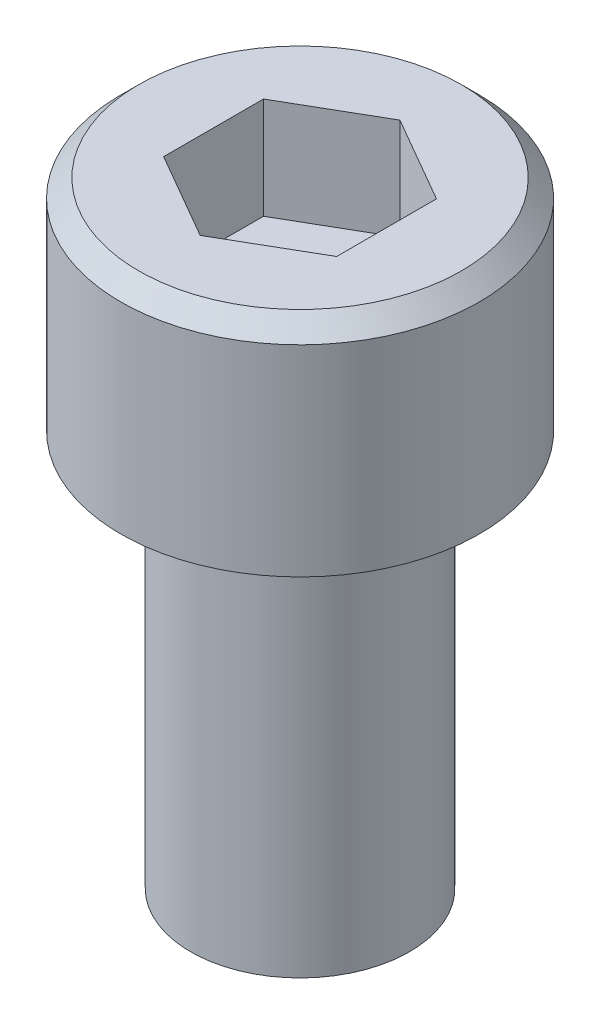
ISO-10303-21;
HEADER;
FILE_DESCRIPTION(('STEP AP214'),'2;1');
FILE_NAME('part.step','',(''),(''),'','','');
FILE_SCHEMA(('AUTOMOTIVE_DESIGN { 1 0 10303 214 1 1 1 1 }'));
ENDSEC;
DATA;
#1=APPLICATION_CONTEXT('core data for automotive mechanical design processes');
#2=APPLICATION_PROTOCOL_DEFINITION('international standard','automotive_design',2000,#1);
#3=PRODUCT_CONTEXT('',#1,'mechanical');
#4=PRODUCT('Part','Part','',(#3));
#5=PRODUCT_RELATED_PRODUCT_CATEGORY('part','',(#4));
#6=PRODUCT_DEFINITION_FORMATION('','',#4);
#7=PRODUCT_DEFINITION_CONTEXT('part definition',#1,'design');
#8=PRODUCT_DEFINITION('design','',#6,#7);
#9=PRODUCT_DEFINITION_SHAPE('','',#8);
#10=(LENGTH_UNIT() NAMED_UNIT(*) SI_UNIT(.MILLI.,.METRE.));
#11=(NAMED_UNIT(*) PLANE_ANGLE_UNIT() SI_UNIT($,.RADIAN.));
#12=(NAMED_UNIT(*) SI_UNIT($,.STERADIAN.) SOLID_ANGLE_UNIT());
#13=UNCERTAINTY_MEASURE_WITH_UNIT(LENGTH_MEASURE(1.E-05),#10,'distance_accuracy_value','');
#14=(GEOMETRIC_REPRESENTATION_CONTEXT(3) GLOBAL_UNCERTAINTY_ASSIGNED_CONTEXT((#13)) GLOBAL_UNIT_ASSIGNED_CONTEXT((#10,
#11,#12)) REPRESENTATION_CONTEXT('',''));
#15=CARTESIAN_POINT('',(0.,0.,0.));
#16=DIRECTION('',(0.,0.,1.));
#17=DIRECTION('',(1.,0.,0.));
#18=AXIS2_PLACEMENT_3D('',#15,#16,#17);
#19=CARTESIAN_POINT('',(0.,0.,0.));
#20=DIRECTION('',(0.,-1.,0.));
#21=DIRECTION('',(0.,0.,-1.00000000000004));
#22=AXIS2_PLACEMENT_3D('',#19,#20,#21);
#23=PLANE('',#22);
#24=CARTESIAN_POINT('',(0.,0.,0.));
#25=DIRECTION('',(0.,-1.,0.));
#26=DIRECTION('',(0.,0.,-1.00000000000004));
#27=AXIS2_PLACEMENT_3D('',#24,#25,#26);
#28=CIRCLE('',#27,1.752598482);
#29=CARTESIAN_POINT('',(0.,0.,-1.75259848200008));
#30=VERTEX_POINT('',#29);
#31=EDGE_CURVE('E11',#30,#30,#28,.T.);
#32=ORIENTED_EDGE('',*,*,#31,.F.);
#33=EDGE_LOOP('',(#32));
#34=FACE_BOUND('',#33,.T.);
#35=CARTESIAN_POINT('',(0.,0.,0.));
#36=DIRECTION('',(0.,-1.,0.));
#37=DIRECTION('',(0.,0.,-1.00000000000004));
#38=AXIS2_PLACEMENT_3D('',#35,#36,#37);
#39=CIRCLE('',#38,2.870197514);
#40=CARTESIAN_POINT('',(0.,0.,-2.87019751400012));
#41=VERTEX_POINT('',#40);
#42=EDGE_CURVE('E41',#41,#41,#39,.T.);
#43=ORIENTED_EDGE('',*,*,#42,.T.);
#44=EDGE_LOOP('',(#43));
#45=FACE_BOUND('',#44,.T.);
#46=ADVANCED_FACE('F38',(#34,#45),#23,.T.);
#47=CARTESIAN_POINT('',(0.,0.,0.));
#48=DIRECTION('',(0.,-1.,0.));
#49=DIRECTION('',(0.,0.,-1.00000000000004));
#50=AXIS2_PLACEMENT_3D('',#47,#48,#49);
#51=CYLINDRICAL_SURFACE('',#50,2.870197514);
#52=CARTESIAN_POINT('',(0.,3.21817727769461,0.));
#53=DIRECTION('',(0.,-1.,0.));
#54=DIRECTION('',(0.,0.,-1.00000000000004));
#55=AXIS2_PLACEMENT_3D('',#52,#53,#54);
#56=CIRCLE('',#55,2.870197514);
#57=CARTESIAN_POINT('',(0.,3.21817727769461,-2.87019751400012));
#58=VERTEX_POINT('',#57);
#59=EDGE_CURVE('E152',#58,#58,#56,.T.);
#60=ORIENTED_EDGE('',*,*,#59,.T.);
#61=EDGE_LOOP('',(#60));
#62=FACE_BOUND('',#61,.T.);
#63=ORIENTED_EDGE('',*,*,#42,.F.);
#64=EDGE_LOOP('',(#63));
#65=FACE_BOUND('',#64,.T.);
#66=ADVANCED_FACE('F160',(#62,#65),#51,.T.);
#67=CARTESIAN_POINT('',(0.,3.21817727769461,0.));
#68=DIRECTION('',(0.,-1.,0.));
#69=DIRECTION('',(0.,0.,-1.00000000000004));
#70=AXIS2_PLACEMENT_3D('',#67,#68,#69);
#71=CONICAL_SURFACE('',#70,2.870197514,0.785398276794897);
#72=CARTESIAN_POINT('',(0.,3.50519696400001,0.));
#73=DIRECTION('',(0.,-1.,0.));
#74=DIRECTION('',(0.,0.,-1.00000000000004));
#75=AXIS2_PLACEMENT_3D('',#72,#73,#74);
#76=CIRCLE('',#75,2.5831777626);
#77=CARTESIAN_POINT('',(0.,3.50519696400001,-2.58317776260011));
#78=VERTEX_POINT('',#77);
#79=EDGE_CURVE('E150',#78,#78,#76,.T.);
#80=ORIENTED_EDGE('',*,*,#79,.T.);
#81=EDGE_LOOP('',(#80));
#82=FACE_BOUND('',#81,.T.);
#83=ORIENTED_EDGE('',*,*,#59,.F.);
#84=EDGE_LOOP('',(#83));
#85=FACE_BOUND('',#84,.T.);
#86=ADVANCED_FACE('F162',(#82,#85),#71,.T.);
#87=CARTESIAN_POINT('',(2.58317776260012,3.50519696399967,0.));
#88=DIRECTION('',(0.,1.,0.));
#89=DIRECTION('',(0.,0.,1.00000000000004));
#90=AXIS2_PLACEMENT_3D('',#87,#88,#89);
#91=PLANE('',#90);
#92=DIRECTION('',(-4.53589793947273E-07,0.,0.999999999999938));
#93=VECTOR('',#92,1.);
#94=CARTESIAN_POINT('',(-1.38429807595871,3.50519696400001,-0.799226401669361));
#95=LINE('',#94,#93);
#96=CARTESIAN_POINT('',(-1.38429807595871,3.50519696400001,-0.799226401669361));
#97=VERTEX_POINT('',#96);
#98=CARTESIAN_POINT('',(-1.384298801,3.50519696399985,0.799225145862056));
#99=VERTEX_POINT('',#98);
#100=EDGE_CURVE('E53',#97,#99,#95,.T.);
#101=ORIENTED_EDGE('',*,*,#100,.F.);
#102=DIRECTION('',(-0.866025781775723,0.,0.499999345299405));
#103=VECTOR('',#102,1.);
#104=CARTESIAN_POINT('',(1.08756126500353E-06,3.50519696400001,-1.59845050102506));
#105=LINE('',#104,#103);
#106=CARTESIAN_POINT('',(1.08756126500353E-06,3.50519696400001,-1.59845050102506));
#107=VERTEX_POINT('',#106);
#108=EDGE_CURVE('E123',#107,#97,#105,.T.);
#109=ORIENTED_EDGE('',*,*,#108,.F.);
#110=DIRECTION('',(-0.866025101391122,0.,-0.500000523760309));
#111=VECTOR('',#110,1.);
#112=CARTESIAN_POINT('',(1.38429916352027,3.50519696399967,-0.799224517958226));
#113=LINE('',#112,#111);
#114=CARTESIAN_POINT('',(1.38429916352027,3.50519696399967,-0.799224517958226));
#115=VERTEX_POINT('',#114);
#116=EDGE_CURVE('E117',#115,#107,#113,.T.);
#117=ORIENTED_EDGE('',*,*,#116,.F.);
#118=DIRECTION('',(4.53589793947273E-07,0.,-0.999999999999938));
#119=VECTOR('',#118,1.);
#120=CARTESIAN_POINT('',(1.38429843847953,3.50519696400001,0.799225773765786));
#121=LINE('',#120,#119);
#122=CARTESIAN_POINT('',(1.38429843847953,3.50519696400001,0.799225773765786));
#123=VERTEX_POINT('',#122);
#124=EDGE_CURVE('E115',#123,#115,#121,.T.);
#125=ORIENTED_EDGE('',*,*,#124,.F.);
#126=DIRECTION('',(0.866025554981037,0.,-0.49999973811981));
#127=VECTOR('',#126,1.);
#128=CARTESIAN_POINT('',(-3.62520426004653E-07,3.5051969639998,1.59845050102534));
#129=LINE('',#128,#127);
#130=CARTESIAN_POINT('',(-3.62520426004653E-07,3.5051969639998,1.59845050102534));
#131=VERTEX_POINT('',#130);
#132=EDGE_CURVE('E96',#131,#123,#129,.T.);
#133=ORIENTED_EDGE('',*,*,#132,.F.);
#134=DIRECTION('',(0.866025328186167,0.,0.500000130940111));
#135=VECTOR('',#134,1.);
#136=CARTESIAN_POINT('',(-1.38429880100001,3.50519696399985,0.799225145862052));
#137=LINE('',#136,#135);
#138=EDGE_CURVE('E107',#99,#131,#137,.T.);
#139=ORIENTED_EDGE('',*,*,#138,.F.);
#140=EDGE_LOOP('',(#101,#109,#117,#125,#133,#139));
#141=FACE_BOUND('',#140,.T.);
#142=ORIENTED_EDGE('',*,*,#79,.F.);
#143=EDGE_LOOP('',(#142));
#144=FACE_BOUND('',#143,.T.);
#145=ADVANCED_FACE('F111',(#141,#144),#91,.T.);
#146=CARTESIAN_POINT('',(0.,-6.3499945,0.));
#147=DIRECTION('',(0.,-1.,0.));
#148=DIRECTION('',(0.,0.,-1.00000000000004));
#149=AXIS2_PLACEMENT_3D('',#146,#147,#148);
#150=PLANE('',#149);
#151=CARTESIAN_POINT('',(0.,-6.3499945,0.));
#152=DIRECTION('',(0.,-1.,0.));
#153=DIRECTION('',(0.,0.,-1.00000000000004));
#154=AXIS2_PLACEMENT_3D('',#151,#152,#153);
#155=CIRCLE('',#154,1.752598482);
#156=CARTESIAN_POINT('',(0.,-6.3499945,-1.75259848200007));
#157=VERTEX_POINT('',#156);
#158=EDGE_CURVE('E146',#157,#157,#155,.T.);
#159=ORIENTED_EDGE('',*,*,#158,.T.);
#160=EDGE_LOOP('',(#159));
#161=FACE_BOUND('',#160,.T.);
#162=ADVANCED_FACE('F173',(#161),#150,.T.);
#163=CARTESIAN_POINT('',(0.,0.,0.));
#164=DIRECTION('',(0.,-1.,0.));
#165=DIRECTION('',(0.,0.,-1.00000000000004));
#166=AXIS2_PLACEMENT_3D('',#163,#164,#165);
#167=CYLINDRICAL_SURFACE('',#166,1.752598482);
#168=ORIENTED_EDGE('',*,*,#31,.T.);
#169=EDGE_LOOP('',(#168));
#170=FACE_BOUND('',#169,.T.);
#171=ORIENTED_EDGE('',*,*,#158,.F.);
#172=EDGE_LOOP('',(#171));
#173=FACE_BOUND('',#172,.T.);
#174=ADVANCED_FACE('F176',(#170,#173),#167,.T.);
#175=CARTESIAN_POINT('',(-1.38429807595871,1.879598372,-0.799226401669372));
#176=DIRECTION('',(-0.999999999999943,0.,-4.53589792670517E-07));
#177=DIRECTION('',(-4.53589793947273E-07,0.,0.999999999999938));
#178=AXIS2_PLACEMENT_3D('',#175,#176,#177);
#179=PLANE('',#178);
#180=DIRECTION('',(0.,1.,0.));
#181=VECTOR('',#180,1.);
#182=CARTESIAN_POINT('',(-1.38429807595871,1.879598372,-0.799226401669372));
#183=LINE('',#182,#181);
#184=CARTESIAN_POINT('',(-1.38429807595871,1.879598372,-0.799226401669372));
#185=VERTEX_POINT('',#184);
#186=EDGE_CURVE('E60',#185,#97,#183,.T.);
#187=ORIENTED_EDGE('',*,*,#186,.T.);
#188=ORIENTED_EDGE('',*,*,#100,.T.);
#189=DIRECTION('',(0.,1.,0.));
#190=VECTOR('',#189,1.);
#191=CARTESIAN_POINT('',(-1.38429880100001,1.87959837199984,0.799225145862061));
#192=LINE('',#191,#190);
#193=CARTESIAN_POINT('',(-1.38429880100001,1.87959837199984,0.799225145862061));
#194=VERTEX_POINT('',#193);
#195=EDGE_CURVE('E104',#194,#99,#192,.T.);
#196=ORIENTED_EDGE('',*,*,#195,.F.);
#197=DIRECTION('',(-4.53589793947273E-07,0.,0.999999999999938));
#198=VECTOR('',#197,1.);
#199=CARTESIAN_POINT('',(-1.38429807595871,1.879598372,-0.799226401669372));
#200=LINE('',#199,#198);
#201=EDGE_CURVE('E125',#185,#194,#200,.T.);
#202=ORIENTED_EDGE('',*,*,#201,.F.);
#203=EDGE_LOOP('',(#187,#188,#196,#202));
#204=FACE_BOUND('',#203,.T.);
#205=ADVANCED_FACE('F180',(#204),#179,.F.);
#206=CARTESIAN_POINT('',(1.08756126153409E-06,1.879598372,-1.59845050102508));
#207=DIRECTION('',(-0.499999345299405,0.,-0.866025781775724));
#208=DIRECTION('',(-0.866025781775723,0.,0.499999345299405));
#209=AXIS2_PLACEMENT_3D('',#206,#207,#208);
#210=PLANE('',#209);
#211=DIRECTION('',(0.,1.,0.));
#212=VECTOR('',#211,1.);
#213=CARTESIAN_POINT('',(1.08756126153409E-06,1.879598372,-1.59845050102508));
#214=LINE('',#213,#212);
#215=CARTESIAN_POINT('',(1.08756126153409E-06,1.879598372,-1.59845050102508));
#216=VERTEX_POINT('',#215);
#217=EDGE_CURVE('E144',#216,#107,#214,.T.);
#218=ORIENTED_EDGE('',*,*,#217,.T.);
#219=ORIENTED_EDGE('',*,*,#108,.T.);
#220=ORIENTED_EDGE('',*,*,#186,.F.);
#221=DIRECTION('',(-0.866025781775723,0.,0.499999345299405));
#222=VECTOR('',#221,1.);
#223=CARTESIAN_POINT('',(1.08756126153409E-06,1.879598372,-1.59845050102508));
#224=LINE('',#223,#222);
#225=EDGE_CURVE('E137',#216,#185,#224,.T.);
#226=ORIENTED_EDGE('',*,*,#225,.F.);
#227=EDGE_LOOP('',(#218,#219,#220,#226));
#228=FACE_BOUND('',#227,.T.);
#229=ADVANCED_FACE('F182',(#228),#210,.F.);
#230=CARTESIAN_POINT('',(1.38429916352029,1.87959837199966,-0.799224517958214));
#231=DIRECTION('',(0.500000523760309,0.,-0.866025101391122));
#232=DIRECTION('',(-0.866025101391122,0.,-0.500000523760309));
#233=AXIS2_PLACEMENT_3D('',#230,#231,#232);
#234=PLANE('',#233);
#235=DIRECTION('',(0.,1.,0.));
#236=VECTOR('',#235,1.);
#237=CARTESIAN_POINT('',(1.38429916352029,1.87959837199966,-0.799224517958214));
#238=LINE('',#237,#236);
#239=CARTESIAN_POINT('',(1.38429916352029,1.87959837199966,-0.799224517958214));
#240=VERTEX_POINT('',#239);
#241=EDGE_CURVE('E142',#240,#115,#238,.T.);
#242=ORIENTED_EDGE('',*,*,#241,.T.);
#243=ORIENTED_EDGE('',*,*,#116,.T.);
#244=ORIENTED_EDGE('',*,*,#217,.F.);
#245=DIRECTION('',(-0.866025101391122,0.,-0.500000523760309));
#246=VECTOR('',#245,1.);
#247=CARTESIAN_POINT('',(1.38429916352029,1.87959837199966,-0.799224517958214));
#248=LINE('',#247,#246);
#249=EDGE_CURVE('E134',#240,#216,#248,.T.);
#250=ORIENTED_EDGE('',*,*,#249,.F.);
#251=EDGE_LOOP('',(#242,#243,#244,#250));
#252=FACE_BOUND('',#251,.T.);
#253=ADVANCED_FACE('F185',(#252),#234,.F.);
#254=CARTESIAN_POINT('',(1.38429843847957,1.879598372,0.799225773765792));
#255=DIRECTION('',(0.999999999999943,0.,4.53589792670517E-07));
#256=DIRECTION('',(4.53589793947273E-07,0.,-0.999999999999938));
#257=AXIS2_PLACEMENT_3D('',#254,#255,#256);
#258=PLANE('',#257);
#259=DIRECTION('',(0.,1.,0.));
#260=VECTOR('',#259,1.);
#261=CARTESIAN_POINT('',(1.38429843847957,1.879598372,0.799225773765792));
#262=LINE('',#261,#260);
#263=CARTESIAN_POINT('',(1.38429843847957,1.879598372,0.799225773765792));
#264=VERTEX_POINT('',#263);
#265=EDGE_CURVE('E103',#264,#123,#262,.T.);
#266=ORIENTED_EDGE('',*,*,#265,.T.);
#267=ORIENTED_EDGE('',*,*,#124,.T.);
#268=ORIENTED_EDGE('',*,*,#241,.F.);
#269=DIRECTION('',(4.53589793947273E-07,0.,-0.999999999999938));
#270=VECTOR('',#269,1.);
#271=CARTESIAN_POINT('',(1.38429843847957,1.879598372,0.799225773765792));
#272=LINE('',#271,#270);
#273=EDGE_CURVE('E131',#264,#240,#272,.T.);
#274=ORIENTED_EDGE('',*,*,#273,.F.);
#275=EDGE_LOOP('',(#266,#267,#268,#274));
#276=FACE_BOUND('',#275,.T.);
#277=ADVANCED_FACE('F188',(#276),#258,.F.);
#278=CARTESIAN_POINT('',(-3.62520407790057E-07,1.87959837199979,1.59845050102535));
#279=DIRECTION('',(0.49999973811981,0.,0.866025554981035));
#280=DIRECTION('',(0.866025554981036,0.,-0.499999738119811));
#281=AXIS2_PLACEMENT_3D('',#278,#279,#280);
#282=PLANE('',#281);
#283=DIRECTION('',(0.,1.,0.));
#284=VECTOR('',#283,1.);
#285=CARTESIAN_POINT('',(-3.62520407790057E-07,1.87959837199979,1.59845050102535));
#286=LINE('',#285,#284);
#287=CARTESIAN_POINT('',(-3.62520407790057E-07,1.87959837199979,1.59845050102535));
#288=VERTEX_POINT('',#287);
#289=EDGE_CURVE('E92',#288,#131,#286,.T.);
#290=ORIENTED_EDGE('',*,*,#289,.T.);
#291=ORIENTED_EDGE('',*,*,#132,.T.);
#292=ORIENTED_EDGE('',*,*,#265,.F.);
#293=DIRECTION('',(0.866025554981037,0.,-0.49999973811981));
#294=VECTOR('',#293,1.);
#295=CARTESIAN_POINT('',(-3.62520407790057E-07,1.87959837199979,1.59845050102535));
#296=LINE('',#295,#294);
#297=EDGE_CURVE('E99',#288,#264,#296,.T.);
#298=ORIENTED_EDGE('',*,*,#297,.F.);
#299=EDGE_LOOP('',(#290,#291,#292,#298));
#300=FACE_BOUND('',#299,.T.);
#301=ADVANCED_FACE('F94',(#300),#282,.F.);
#302=CARTESIAN_POINT('',(-1.38429880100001,1.87959837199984,0.799225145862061));
#303=DIRECTION('',(-0.500000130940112,0.,0.866025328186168));
#304=DIRECTION('',(0.866025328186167,0.,0.500000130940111));
#305=AXIS2_PLACEMENT_3D('',#302,#303,#304);
#306=PLANE('',#305);
#307=DIRECTION('',(0.866025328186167,0.,0.500000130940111));
#308=VECTOR('',#307,1.);
#309=CARTESIAN_POINT('',(-1.38429880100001,1.87959837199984,0.799225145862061));
#310=LINE('',#309,#308);
#311=EDGE_CURVE('E128',#194,#288,#310,.T.);
#312=ORIENTED_EDGE('',*,*,#311,.F.);
#313=ORIENTED_EDGE('',*,*,#195,.T.);
#314=ORIENTED_EDGE('',*,*,#138,.T.);
#315=ORIENTED_EDGE('',*,*,#289,.F.);
#316=EDGE_LOOP('',(#312,#313,#314,#315));
#317=FACE_BOUND('',#316,.T.);
#318=ADVANCED_FACE('F108',(#317),#306,.F.);
#319=CARTESIAN_POINT('',(-1.38429807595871,1.879598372,-0.799226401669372));
#320=DIRECTION('',(0.,-1.,0.));
#321=DIRECTION('',(0.,0.,-1.00000000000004));
#322=AXIS2_PLACEMENT_3D('',#319,#320,#321);
#323=PLANE('',#322);
#324=ORIENTED_EDGE('',*,*,#201,.T.);
#325=ORIENTED_EDGE('',*,*,#311,.T.);
#326=ORIENTED_EDGE('',*,*,#297,.T.);
#327=ORIENTED_EDGE('',*,*,#273,.T.);
#328=ORIENTED_EDGE('',*,*,#249,.T.);
#329=ORIENTED_EDGE('',*,*,#225,.T.);
#330=EDGE_LOOP('',(#324,#325,#326,#327,#328,#329));
#331=FACE_BOUND('',#330,.T.);
#332=ADVANCED_FACE('F195',(#331),#323,.F.);
#333=CLOSED_SHELL('',(#46,#66,#86,#145,#162,#174,#205,#229,#253,#277,#301,#318,#332));
#334=MANIFOLD_SOLID_BREP('B2',#333);
#335=ADVANCED_BREP_SHAPE_REPRESENTATION('',(#18,#334),#14);
#336=SHAPE_DEFINITION_REPRESENTATION(#9,#335);
ENDSEC;
END-ISO-10303-21;
